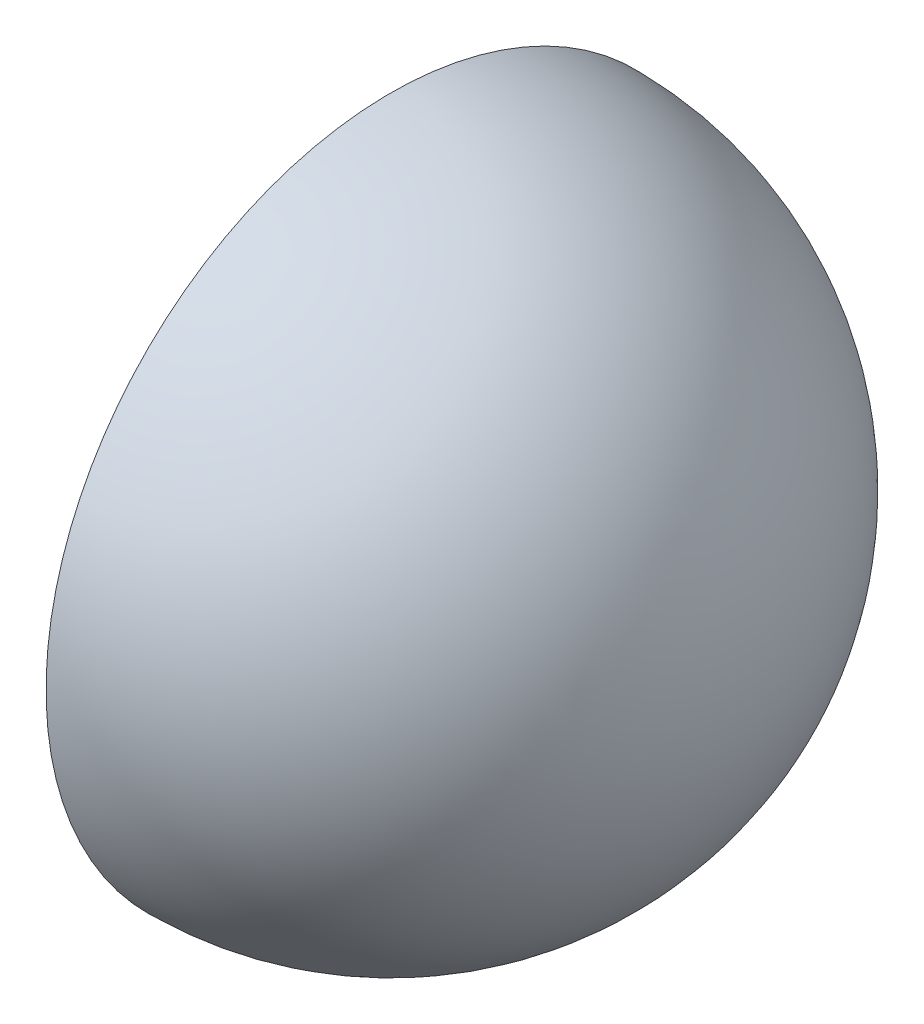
ISO-10303-21;
HEADER;
FILE_DESCRIPTION(('STEP AP214'),'2;1');
FILE_NAME('part.step','',(''),(''),'','','');
FILE_SCHEMA(('AUTOMOTIVE_DESIGN { 1 0 10303 214 1 1 1 1 }'));
ENDSEC;
DATA;
#1=APPLICATION_CONTEXT('core data for automotive mechanical design processes');
#2=APPLICATION_PROTOCOL_DEFINITION('international standard','automotive_design',2000,#1);
#3=PRODUCT_CONTEXT('',#1,'mechanical');
#4=PRODUCT('Part','Part','',(#3));
#5=PRODUCT_RELATED_PRODUCT_CATEGORY('part','',(#4));
#6=PRODUCT_DEFINITION_FORMATION('','',#4);
#7=PRODUCT_DEFINITION_CONTEXT('part definition',#1,'design');
#8=PRODUCT_DEFINITION('design','',#6,#7);
#9=PRODUCT_DEFINITION_SHAPE('','',#8);
#10=(LENGTH_UNIT() NAMED_UNIT(*) SI_UNIT(.MILLI.,.METRE.));
#11=(NAMED_UNIT(*) PLANE_ANGLE_UNIT() SI_UNIT($,.RADIAN.));
#12=(NAMED_UNIT(*) SI_UNIT($,.STERADIAN.) SOLID_ANGLE_UNIT());
#13=UNCERTAINTY_MEASURE_WITH_UNIT(LENGTH_MEASURE(1.E-05),#10,'distance_accuracy_value','');
#14=(GEOMETRIC_REPRESENTATION_CONTEXT(3) GLOBAL_UNCERTAINTY_ASSIGNED_CONTEXT((#13)) GLOBAL_UNIT_ASSIGNED_CONTEXT((#10,
#11,#12)) REPRESENTATION_CONTEXT('',''));
#15=CARTESIAN_POINT('',(0.,0.,0.));
#16=DIRECTION('',(0.,0.,1.));
#17=DIRECTION('',(1.,0.,0.));
#18=AXIS2_PLACEMENT_3D('',#15,#16,#17);
#19=CARTESIAN_POINT('',(0.,0.,0.));
#20=DIRECTION('',(0.,-1.,0.));
#21=DIRECTION('',(1.,0.,0.));
#22=AXIS2_PLACEMENT_3D('',#19,#20,#21);
#23=SPHERICAL_SURFACE('',#22,38.1);
#24=CARTESIAN_POINT('',(0.,0.,0.));
#25=DIRECTION('',(1.,0.,0.));
#26=DIRECTION('',(0.,0.,-1.));
#27=AXIS2_PLACEMENT_3D('',#24,#25,#26);
#28=SPHERICAL_SURFACE('',#27,38.1);
#29=CARTESIAN_POINT('',(0.,0.,0.));
#30=DIRECTION('',(1.,0.,0.));
#31=DIRECTION('',(0.,0.,-1.));
#32=AXIS2_PLACEMENT_3D('',#29,#30,#31);
#33=CIRCLE('',#32,38.1);
#34=CARTESIAN_POINT('',(0.,0.,-38.1));
#35=VERTEX_POINT('',#34);
#36=EDGE_CURVE('E38',#35,#35,#33,.F.);
#37=ORIENTED_EDGE('',*,*,#36,.T.);
#38=EDGE_LOOP('',(#37));
#39=FACE_BOUND('',#38,.T.);
#40=ADVANCED_FACE('F35',(#39),#28,.F.);
#41=CARTESIAN_POINT('',(0.,0.,0.));
#42=DIRECTION('',(1.,0.,0.));
#43=DIRECTION('',(0.,0.,-1.));
#44=AXIS2_PLACEMENT_3D('',#41,#42,#43);
#45=PLANE('',#44);
#46=ORIENTED_EDGE('',*,*,#36,.F.);
#47=EDGE_LOOP('',(#46));
#48=FACE_BOUND('',#47,.T.);
#49=CARTESIAN_POINT('',(0.,0.,0.));
#50=DIRECTION('',(1.,0.,0.));
#51=DIRECTION('',(0.,0.,-1.));
#52=AXIS2_PLACEMENT_3D('',#49,#50,#51);
#53=CIRCLE('',#52,50.8);
#54=CARTESIAN_POINT('',(0.,0.,-50.8));
#55=VERTEX_POINT('',#54);
#56=EDGE_CURVE('E10',#55,#55,#53,.T.);
#57=ORIENTED_EDGE('',*,*,#56,.F.);
#58=EDGE_LOOP('',(#57));
#59=FACE_BOUND('',#58,.T.);
#60=ADVANCED_FACE('F48',(#48,#59),#45,.F.);
#61=CARTESIAN_POINT('',(0.,0.,0.));
#62=DIRECTION('',(0.,-1.,0.));
#63=DIRECTION('',(-1.,0.,0.));
#64=AXIS2_PLACEMENT_3D('',#61,#62,#63);
#65=SPHERICAL_SURFACE('',#64,50.8);
#66=CARTESIAN_POINT('',(0.,0.,0.));
#67=DIRECTION('',(1.,0.,0.));
#68=DIRECTION('',(0.,0.,-1.));
#69=AXIS2_PLACEMENT_3D('',#66,#67,#68);
#70=SPHERICAL_SURFACE('',#69,50.8);
#71=ORIENTED_EDGE('',*,*,#56,.T.);
#72=EDGE_LOOP('',(#71));
#73=FACE_BOUND('',#72,.T.);
#74=ADVANCED_FACE('F51',(#73),#70,.T.);
#75=CLOSED_SHELL('',(#40,#60,#74));
#76=MANIFOLD_SOLID_BREP('B2',#75);
#77=ADVANCED_BREP_SHAPE_REPRESENTATION('',(#18,#76),#14);
#78=SHAPE_DEFINITION_REPRESENTATION(#9,#77);
ENDSEC;
END-ISO-10303-21;
